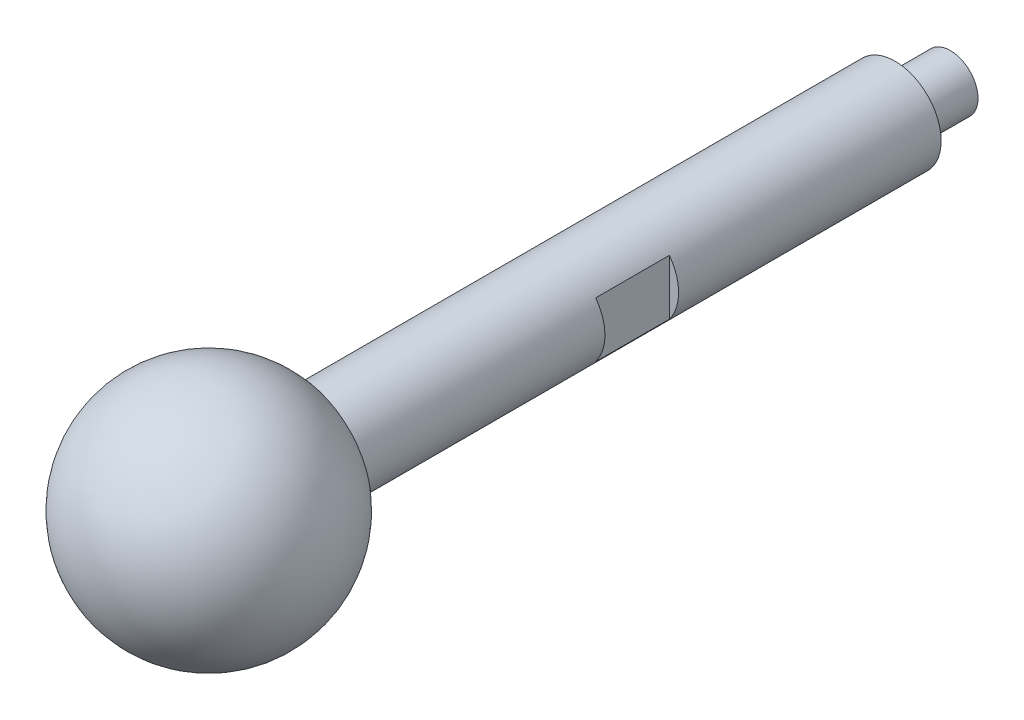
ISO-10303-21;
HEADER;
FILE_DESCRIPTION(('STEP AP214'),'2;1');
FILE_NAME('part.step','',(''),(''),'','','');
FILE_SCHEMA(('AUTOMOTIVE_DESIGN { 1 0 10303 214 1 1 1 1 }'));
ENDSEC;
DATA;
#1=APPLICATION_CONTEXT('core data for automotive mechanical design processes');
#2=APPLICATION_PROTOCOL_DEFINITION('international standard','automotive_design',2000,#1);
#3=PRODUCT_CONTEXT('',#1,'mechanical');
#4=PRODUCT('Part','Part','',(#3));
#5=PRODUCT_RELATED_PRODUCT_CATEGORY('part','',(#4));
#6=PRODUCT_DEFINITION_FORMATION('','',#4);
#7=PRODUCT_DEFINITION_CONTEXT('part definition',#1,'design');
#8=PRODUCT_DEFINITION('design','',#6,#7);
#9=PRODUCT_DEFINITION_SHAPE('','',#8);
#10=(LENGTH_UNIT() NAMED_UNIT(*) SI_UNIT(.MILLI.,.METRE.));
#11=(NAMED_UNIT(*) PLANE_ANGLE_UNIT() SI_UNIT($,.RADIAN.));
#12=(NAMED_UNIT(*) SI_UNIT($,.STERADIAN.) SOLID_ANGLE_UNIT());
#13=UNCERTAINTY_MEASURE_WITH_UNIT(LENGTH_MEASURE(1.E-05),#10,'distance_accuracy_value','');
#14=(GEOMETRIC_REPRESENTATION_CONTEXT(3) GLOBAL_UNCERTAINTY_ASSIGNED_CONTEXT((#13)) GLOBAL_UNIT_ASSIGNED_CONTEXT((#10,
#11,#12)) REPRESENTATION_CONTEXT('',''));
#15=CARTESIAN_POINT('',(0.,0.,0.));
#16=DIRECTION('',(0.,0.,1.));
#17=DIRECTION('',(1.,0.,0.));
#18=AXIS2_PLACEMENT_3D('',#15,#16,#17);
#19=CARTESIAN_POINT('',(0.,0.,0.));
#20=DIRECTION('',(0.,0.,-1.));
#21=DIRECTION('',(0.,-1.,0.));
#22=AXIS2_PLACEMENT_3D('',#19,#20,#21);
#23=PLANE('',#22);
#24=CARTESIAN_POINT('',(0.,0.,0.));
#25=DIRECTION('',(0.,0.,-1.));
#26=DIRECTION('',(0.,-1.,0.));
#27=AXIS2_PLACEMENT_3D('',#24,#25,#26);
#28=CIRCLE('',#27,5.);
#29=CARTESIAN_POINT('',(0.,-5.,0.));
#30=VERTEX_POINT('',#29);
#31=EDGE_CURVE('E93',#30,#30,#28,.T.);
#32=ORIENTED_EDGE('',*,*,#31,.T.);
#33=EDGE_LOOP('',(#32));
#34=FACE_BOUND('',#33,.T.);
#35=CARTESIAN_POINT('',(0.,0.,0.));
#36=DIRECTION('',(0.,0.,-1.));
#37=DIRECTION('',(0.,-1.,0.));
#38=AXIS2_PLACEMENT_3D('',#35,#36,#37);
#39=CIRCLE('',#38,3.);
#40=CARTESIAN_POINT('',(0.,-3.,0.));
#41=VERTEX_POINT('',#40);
#42=EDGE_CURVE('E9',#41,#41,#39,.T.);
#43=ORIENTED_EDGE('',*,*,#42,.F.);
#44=EDGE_LOOP('',(#43));
#45=FACE_BOUND('',#44,.T.);
#46=ADVANCED_FACE('F14',(#34,#45),#23,.T.);
#47=CARTESIAN_POINT('',(0.,0.,65.));
#48=DIRECTION('',(0.,0.,1.));
#49=DIRECTION('',(-0.330600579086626,0.943770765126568,0.));
#50=AXIS2_PLACEMENT_3D('',#47,#48,#49);
#51=PLANE('',#50);
#52=CARTESIAN_POINT('',(0.,0.,65.));
#53=DIRECTION('',(0.,0.,-1.));
#54=DIRECTION('',(0.330600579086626,-0.943770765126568,0.));
#55=AXIS2_PLACEMENT_3D('',#52,#53,#54);
#56=CIRCLE('',#55,8.12403840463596);
#57=CARTESIAN_POINT('',(2.68581180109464,-7.6672299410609,65.));
#58=VERTEX_POINT('',#57);
#59=EDGE_CURVE('E65',#58,#58,#56,.T.);
#60=ORIENTED_EDGE('',*,*,#59,.T.);
#61=EDGE_LOOP('',(#60));
#62=FACE_BOUND('',#61,.T.);
#63=CARTESIAN_POINT('',(0.,0.,65.));
#64=DIRECTION('',(0.,0.,-1.));
#65=DIRECTION('',(0.,-1.,0.));
#66=AXIS2_PLACEMENT_3D('',#63,#64,#65);
#67=CIRCLE('',#66,5.);
#68=CARTESIAN_POINT('',(0.,-5.,65.));
#69=VERTEX_POINT('',#68);
#70=EDGE_CURVE('E81',#69,#69,#67,.T.);
#71=ORIENTED_EDGE('',*,*,#70,.F.);
#72=EDGE_LOOP('',(#71));
#73=FACE_BOUND('',#72,.T.);
#74=ADVANCED_FACE('F122',(#62,#73),#51,.F.);
#75=CARTESIAN_POINT('',(0.,0.,74.5));
#76=DIRECTION('',(0.,0.,-1.));
#77=DIRECTION('',(-0.943770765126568,-0.330600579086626,0.));
#78=AXIS2_PLACEMENT_3D('',#75,#76,#77);
#79=SPHERICAL_SURFACE('',#78,12.5);
#80=ORIENTED_EDGE('',*,*,#59,.F.);
#81=EDGE_LOOP('',(#80));
#82=FACE_BOUND('',#81,.T.);
#83=ADVANCED_FACE('F113',(#82),#79,.T.);
#84=CARTESIAN_POINT('',(-4.,4.,28.5));
#85=DIRECTION('',(0.,0.,-1.));
#86=DIRECTION('',(0.,-1.,0.));
#87=AXIS2_PLACEMENT_3D('',#84,#85,#86);
#88=PLANE('',#87);
#89=DIRECTION('',(0.,-1.,0.));
#90=VECTOR('',#89,1.);
#91=CARTESIAN_POINT('',(-4.,4.,28.5));
#92=LINE('',#91,#90);
#93=CARTESIAN_POINT('',(-4.,3.,28.5));
#94=VERTEX_POINT('',#93);
#95=CARTESIAN_POINT('',(-4.,-3.,28.5));
#96=VERTEX_POINT('',#95);
#97=EDGE_CURVE('E69',#94,#96,#92,.T.);
#98=ORIENTED_EDGE('',*,*,#97,.F.);
#99=CARTESIAN_POINT('',(0.,0.,28.5));
#100=DIRECTION('',(0.,0.,-1.));
#101=DIRECTION('',(0.,-1.,0.));
#102=AXIS2_PLACEMENT_3D('',#99,#100,#101);
#103=CIRCLE('',#102,5.);
#104=EDGE_CURVE('E96',#96,#94,#103,.T.);
#105=ORIENTED_EDGE('',*,*,#104,.F.);
#106=EDGE_LOOP('',(#98,#105));
#107=FACE_BOUND('',#106,.T.);
#108=ADVANCED_FACE('F110',(#107),#88,.F.);
#109=CARTESIAN_POINT('',(-4.,4.,36.5));
#110=DIRECTION('',(0.,0.,1.));
#111=DIRECTION('',(0.,1.,0.));
#112=AXIS2_PLACEMENT_3D('',#109,#110,#111);
#113=PLANE('',#112);
#114=DIRECTION('',(0.,1.,0.));
#115=VECTOR('',#114,1.);
#116=CARTESIAN_POINT('',(-4.,4.,36.5));
#117=LINE('',#116,#115);
#118=CARTESIAN_POINT('',(-4.,-3.,36.5));
#119=VERTEX_POINT('',#118);
#120=CARTESIAN_POINT('',(-4.,3.,36.5));
#121=VERTEX_POINT('',#120);
#122=EDGE_CURVE('E91',#119,#121,#117,.T.);
#123=ORIENTED_EDGE('',*,*,#122,.F.);
#124=CARTESIAN_POINT('',(0.,0.,36.5));
#125=DIRECTION('',(0.,0.,1.));
#126=DIRECTION('',(0.,1.,0.));
#127=AXIS2_PLACEMENT_3D('',#124,#125,#126);
#128=CIRCLE('',#127,5.);
#129=EDGE_CURVE('E35',#121,#119,#128,.T.);
#130=ORIENTED_EDGE('',*,*,#129,.F.);
#131=EDGE_LOOP('',(#123,#130));
#132=FACE_BOUND('',#131,.T.);
#133=ADVANCED_FACE('F107',(#132),#113,.F.);
#134=CARTESIAN_POINT('',(-4.,4.,28.5));
#135=DIRECTION('',(-1.,0.,0.));
#136=DIRECTION('',(0.,0.,-1.));
#137=AXIS2_PLACEMENT_3D('',#134,#135,#136);
#138=PLANE('',#137);
#139=DIRECTION('',(0.,0.,1.));
#140=VECTOR('',#139,1.);
#141=CARTESIAN_POINT('',(-4.,-3.,0.));
#142=LINE('',#141,#140);
#143=EDGE_CURVE('E76',#96,#119,#142,.T.);
#144=ORIENTED_EDGE('',*,*,#143,.T.);
#145=ORIENTED_EDGE('',*,*,#122,.T.);
#146=DIRECTION('',(0.,0.,1.));
#147=VECTOR('',#146,1.);
#148=CARTESIAN_POINT('',(-4.,3.,0.));
#149=LINE('',#148,#147);
#150=EDGE_CURVE('E100',#121,#94,#149,.F.);
#151=ORIENTED_EDGE('',*,*,#150,.T.);
#152=ORIENTED_EDGE('',*,*,#97,.T.);
#153=EDGE_LOOP('',(#144,#145,#151,#152));
#154=FACE_BOUND('',#153,.T.);
#155=ADVANCED_FACE('F104',(#154),#138,.T.);
#156=CARTESIAN_POINT('',(4.,-4.,28.5));
#157=DIRECTION('',(0.,0.,-1.));
#158=DIRECTION('',(0.,-1.,0.));
#159=AXIS2_PLACEMENT_3D('',#156,#157,#158);
#160=PLANE('',#159);
#161=DIRECTION('',(0.,1.,0.));
#162=VECTOR('',#161,1.);
#163=CARTESIAN_POINT('',(4.,-4.,28.5));
#164=LINE('',#163,#162);
#165=CARTESIAN_POINT('',(4.,-3.,28.5));
#166=VERTEX_POINT('',#165);
#167=CARTESIAN_POINT('',(4.,3.,28.5));
#168=VERTEX_POINT('',#167);
#169=EDGE_CURVE('E62',#166,#168,#164,.T.);
#170=ORIENTED_EDGE('',*,*,#169,.F.);
#171=CARTESIAN_POINT('',(0.,0.,28.5));
#172=DIRECTION('',(0.,0.,-1.));
#173=DIRECTION('',(0.,-1.,0.));
#174=AXIS2_PLACEMENT_3D('',#171,#172,#173);
#175=CIRCLE('',#174,5.);
#176=EDGE_CURVE('E73',#168,#166,#175,.T.);
#177=ORIENTED_EDGE('',*,*,#176,.F.);
#178=EDGE_LOOP('',(#170,#177));
#179=FACE_BOUND('',#178,.T.);
#180=ADVANCED_FACE('F127',(#179),#160,.F.);
#181=CARTESIAN_POINT('',(4.,-4.,36.5));
#182=DIRECTION('',(0.,0.,1.));
#183=DIRECTION('',(0.,1.,0.));
#184=AXIS2_PLACEMENT_3D('',#181,#182,#183);
#185=PLANE('',#184);
#186=DIRECTION('',(0.,-1.,0.));
#187=VECTOR('',#186,1.);
#188=CARTESIAN_POINT('',(4.,-4.,36.5));
#189=LINE('',#188,#187);
#190=CARTESIAN_POINT('',(4.,3.,36.5));
#191=VERTEX_POINT('',#190);
#192=CARTESIAN_POINT('',(4.,-3.,36.5));
#193=VERTEX_POINT('',#192);
#194=EDGE_CURVE('E59',#191,#193,#189,.T.);
#195=ORIENTED_EDGE('',*,*,#194,.F.);
#196=CARTESIAN_POINT('',(0.,0.,36.5));
#197=DIRECTION('',(0.,0.,1.));
#198=DIRECTION('',(0.,1.,0.));
#199=AXIS2_PLACEMENT_3D('',#196,#197,#198);
#200=CIRCLE('',#199,5.);
#201=EDGE_CURVE('E28',#193,#191,#200,.T.);
#202=ORIENTED_EDGE('',*,*,#201,.F.);
#203=EDGE_LOOP('',(#195,#202));
#204=FACE_BOUND('',#203,.T.);
#205=ADVANCED_FACE('F68',(#204),#185,.F.);
#206=CARTESIAN_POINT('',(4.,-4.,28.5));
#207=DIRECTION('',(1.,0.,0.));
#208=DIRECTION('',(0.,0.,-1.));
#209=AXIS2_PLACEMENT_3D('',#206,#207,#208);
#210=PLANE('',#209);
#211=DIRECTION('',(0.,0.,1.));
#212=VECTOR('',#211,1.);
#213=CARTESIAN_POINT('',(4.,3.,0.));
#214=LINE('',#213,#212);
#215=EDGE_CURVE('E57',#168,#191,#214,.T.);
#216=ORIENTED_EDGE('',*,*,#215,.T.);
#217=ORIENTED_EDGE('',*,*,#194,.T.);
#218=DIRECTION('',(0.,0.,1.));
#219=VECTOR('',#218,1.);
#220=CARTESIAN_POINT('',(4.,-3.,0.));
#221=LINE('',#220,#219);
#222=EDGE_CURVE('E66',#193,#166,#221,.F.);
#223=ORIENTED_EDGE('',*,*,#222,.T.);
#224=ORIENTED_EDGE('',*,*,#169,.T.);
#225=EDGE_LOOP('',(#216,#217,#223,#224));
#226=FACE_BOUND('',#225,.T.);
#227=ADVANCED_FACE('F58',(#226),#210,.T.);
#228=CARTESIAN_POINT('',(0.,0.,0.));
#229=DIRECTION('',(0.,0.,1.));
#230=DIRECTION('',(0.,1.,0.));
#231=AXIS2_PLACEMENT_3D('',#228,#229,#230);
#232=CYLINDRICAL_SURFACE('',#231,5.);
#233=ORIENTED_EDGE('',*,*,#222,.F.);
#234=ORIENTED_EDGE('',*,*,#201,.T.);
#235=ORIENTED_EDGE('',*,*,#215,.F.);
#236=ORIENTED_EDGE('',*,*,#176,.T.);
#237=EDGE_LOOP('',(#233,#234,#235,#236));
#238=FACE_BOUND('',#237,.T.);
#239=ORIENTED_EDGE('',*,*,#150,.F.);
#240=ORIENTED_EDGE('',*,*,#129,.T.);
#241=ORIENTED_EDGE('',*,*,#143,.F.);
#242=ORIENTED_EDGE('',*,*,#104,.T.);
#243=EDGE_LOOP('',(#239,#240,#241,#242));
#244=FACE_BOUND('',#243,.T.);
#245=ORIENTED_EDGE('',*,*,#31,.F.);
#246=EDGE_LOOP('',(#245));
#247=FACE_BOUND('',#246,.T.);
#248=ORIENTED_EDGE('',*,*,#70,.T.);
#249=EDGE_LOOP('',(#248));
#250=FACE_BOUND('',#249,.T.);
#251=ADVANCED_FACE('F71',(#238,#244,#247,#250),#232,.T.);
#252=CARTESIAN_POINT('',(0.,0.,-6.));
#253=DIRECTION('',(0.,0.,1.));
#254=DIRECTION('',(0.,1.,0.));
#255=AXIS2_PLACEMENT_3D('',#252,#253,#254);
#256=PLANE('',#255);
#257=CARTESIAN_POINT('',(0.,0.,-6.));
#258=DIRECTION('',(0.,0.,1.));
#259=DIRECTION('',(0.,1.,0.));
#260=AXIS2_PLACEMENT_3D('',#257,#258,#259);
#261=CIRCLE('',#260,3.);
#262=CARTESIAN_POINT('',(0.,3.,-6.));
#263=VERTEX_POINT('',#262);
#264=EDGE_CURVE('E22',#263,#263,#261,.F.);
#265=ORIENTED_EDGE('',*,*,#264,.T.);
#266=EDGE_LOOP('',(#265));
#267=FACE_BOUND('',#266,.T.);
#268=ADVANCED_FACE('F16',(#267),#256,.F.);
#269=CARTESIAN_POINT('',(0.,0.,14.));
#270=DIRECTION('',(0.,0.,1.));
#271=DIRECTION('',(0.,1.,0.));
#272=AXIS2_PLACEMENT_3D('',#269,#270,#271);
#273=CYLINDRICAL_SURFACE('',#272,3.);
#274=ORIENTED_EDGE('',*,*,#42,.T.);
#275=EDGE_LOOP('',(#274));
#276=FACE_BOUND('',#275,.T.);
#277=ORIENTED_EDGE('',*,*,#264,.F.);
#278=EDGE_LOOP('',(#277));
#279=FACE_BOUND('',#278,.T.);
#280=ADVANCED_FACE('F130',(#276,#279),#273,.T.);
#281=CLOSED_SHELL('',(#46,#74,#83,#108,#133,#155,#180,#205,#227,#251,#268,#280));
#282=MANIFOLD_SOLID_BREP('B1',#281);
#283=ADVANCED_BREP_SHAPE_REPRESENTATION('',(#18,#282),#14);
#284=SHAPE_DEFINITION_REPRESENTATION(#9,#283);
ENDSEC;
END-ISO-10303-21;
